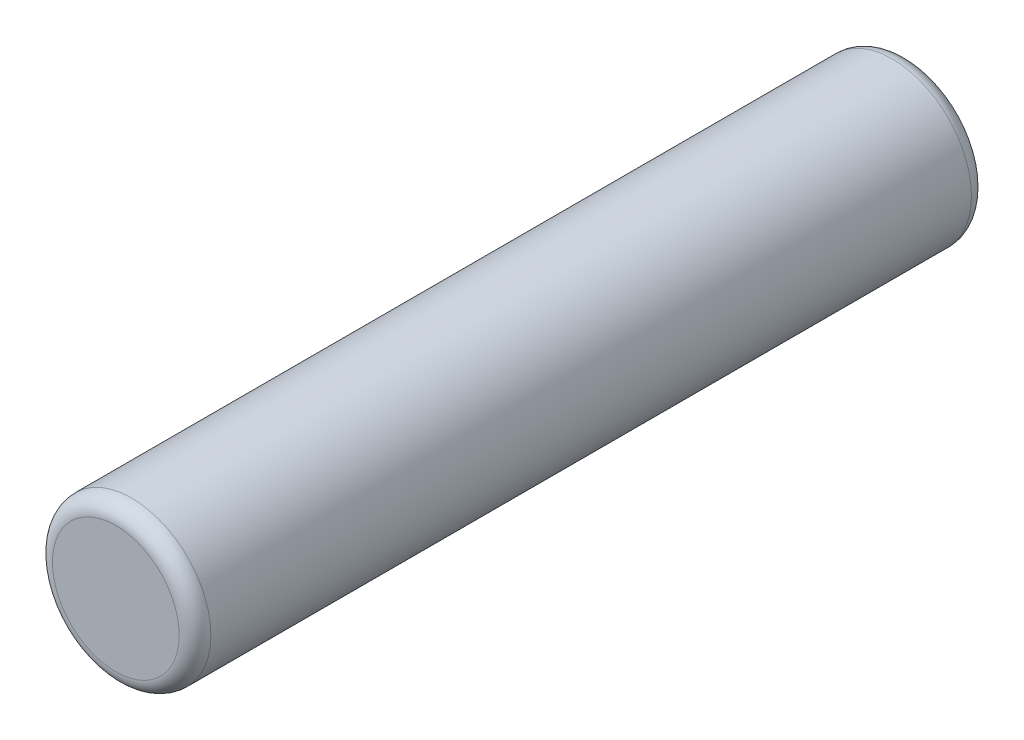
ISO-10303-21;
HEADER;
FILE_DESCRIPTION(('STEP AP214'),'2;1');
FILE_NAME('part.step','',(''),(''),'','','');
FILE_SCHEMA(('AUTOMOTIVE_DESIGN { 1 0 10303 214 1 1 1 1 }'));
ENDSEC;
DATA;
#1=APPLICATION_CONTEXT('core data for automotive mechanical design processes');
#2=APPLICATION_PROTOCOL_DEFINITION('international standard','automotive_design',2000,#1);
#3=PRODUCT_CONTEXT('',#1,'mechanical');
#4=PRODUCT('Part','Part','',(#3));
#5=PRODUCT_RELATED_PRODUCT_CATEGORY('part','',(#4));
#6=PRODUCT_DEFINITION_FORMATION('','',#4);
#7=PRODUCT_DEFINITION_CONTEXT('part definition',#1,'design');
#8=PRODUCT_DEFINITION('design','',#6,#7);
#9=PRODUCT_DEFINITION_SHAPE('','',#8);
#10=(LENGTH_UNIT() NAMED_UNIT(*) SI_UNIT(.MILLI.,.METRE.));
#11=(NAMED_UNIT(*) PLANE_ANGLE_UNIT() SI_UNIT($,.RADIAN.));
#12=(NAMED_UNIT(*) SI_UNIT($,.STERADIAN.) SOLID_ANGLE_UNIT());
#13=UNCERTAINTY_MEASURE_WITH_UNIT(LENGTH_MEASURE(1.E-05),#10,'distance_accuracy_value','');
#14=(GEOMETRIC_REPRESENTATION_CONTEXT(3) GLOBAL_UNCERTAINTY_ASSIGNED_CONTEXT((#13)) GLOBAL_UNIT_ASSIGNED_CONTEXT((#10,
#11,#12)) REPRESENTATION_CONTEXT('',''));
#15=CARTESIAN_POINT('',(0.,0.,0.));
#16=DIRECTION('',(0.,0.,1.));
#17=DIRECTION('',(1.,0.,0.));
#18=AXIS2_PLACEMENT_3D('',#15,#16,#17);
#19=CARTESIAN_POINT('',(0.,0.,100.));
#20=DIRECTION('',(0.,0.,-1.));
#21=DIRECTION('',(-1.,0.,0.));
#22=AXIS2_PLACEMENT_3D('',#19,#20,#21);
#23=CYLINDRICAL_SURFACE('',#22,10.);
#24=CARTESIAN_POINT('',(0.,0.,2.));
#25=DIRECTION('',(0.,0.,1.));
#26=DIRECTION('',(1.,0.,0.));
#27=AXIS2_PLACEMENT_3D('',#24,#25,#26);
#28=CIRCLE('',#27,10.);
#29=CARTESIAN_POINT('',(10.,0.,2.));
#30=VERTEX_POINT('',#29);
#31=EDGE_CURVE('E40',#30,#30,#28,.T.);
#32=ORIENTED_EDGE('',*,*,#31,.T.);
#33=EDGE_LOOP('',(#32));
#34=FACE_BOUND('',#33,.T.);
#35=CARTESIAN_POINT('',(0.,0.,98.));
#36=DIRECTION('',(0.,0.,1.));
#37=DIRECTION('',(1.,0.,0.));
#38=AXIS2_PLACEMENT_3D('',#35,#36,#37);
#39=CIRCLE('',#38,10.);
#40=CARTESIAN_POINT('',(10.,0.,98.));
#41=VERTEX_POINT('',#40);
#42=EDGE_CURVE('E44',#41,#41,#39,.F.);
#43=ORIENTED_EDGE('',*,*,#42,.T.);
#44=EDGE_LOOP('',(#43));
#45=FACE_BOUND('',#44,.T.);
#46=ADVANCED_FACE('F30',(#34,#45),#23,.T.);
#47=CARTESIAN_POINT('',(0.,0.,100.));
#48=DIRECTION('',(0.,0.,1.));
#49=DIRECTION('',(1.,0.,0.));
#50=AXIS2_PLACEMENT_3D('',#47,#48,#49);
#51=PLANE('',#50);
#52=CARTESIAN_POINT('',(0.,0.,100.));
#53=DIRECTION('',(0.,0.,1.));
#54=DIRECTION('',(1.,0.,0.));
#55=AXIS2_PLACEMENT_3D('',#52,#53,#54);
#56=CIRCLE('',#55,8.);
#57=CARTESIAN_POINT('',(8.,0.,100.));
#58=VERTEX_POINT('',#57);
#59=EDGE_CURVE('E10',#58,#58,#56,.T.);
#60=ORIENTED_EDGE('',*,*,#59,.T.);
#61=EDGE_LOOP('',(#60));
#62=FACE_BOUND('',#61,.T.);
#63=ADVANCED_FACE('F63',(#62),#51,.T.);
#64=CARTESIAN_POINT('',(0.,0.,0.));
#65=DIRECTION('',(0.,0.,1.));
#66=DIRECTION('',(1.,0.,0.));
#67=AXIS2_PLACEMENT_3D('',#64,#65,#66);
#68=PLANE('',#67);
#69=CARTESIAN_POINT('',(0.,0.,0.));
#70=DIRECTION('',(0.,0.,1.));
#71=DIRECTION('',(1.,0.,0.));
#72=AXIS2_PLACEMENT_3D('',#69,#70,#71);
#73=CIRCLE('',#72,8.);
#74=CARTESIAN_POINT('',(8.,0.,0.));
#75=VERTEX_POINT('',#74);
#76=EDGE_CURVE('E36',#75,#75,#73,.F.);
#77=ORIENTED_EDGE('',*,*,#76,.T.);
#78=EDGE_LOOP('',(#77));
#79=FACE_BOUND('',#78,.T.);
#80=ADVANCED_FACE('F59',(#79),#68,.F.);
#81=CARTESIAN_POINT('',(0.,0.,2.));
#82=DIRECTION('',(0.,0.,1.));
#83=DIRECTION('',(1.,0.,0.));
#84=AXIS2_PLACEMENT_3D('',#81,#82,#83);
#85=TOROIDAL_SURFACE('',#84,8.,2.);
#86=ORIENTED_EDGE('',*,*,#76,.F.);
#87=EDGE_LOOP('',(#86));
#88=FACE_BOUND('',#87,.T.);
#89=ORIENTED_EDGE('',*,*,#31,.F.);
#90=EDGE_LOOP('',(#89));
#91=FACE_BOUND('',#90,.T.);
#92=ADVANCED_FACE('F54',(#88,#91),#85,.T.);
#93=CARTESIAN_POINT('',(0.,0.,98.));
#94=DIRECTION('',(0.,0.,1.));
#95=DIRECTION('',(1.,0.,0.));
#96=AXIS2_PLACEMENT_3D('',#93,#94,#95);
#97=TOROIDAL_SURFACE('',#96,8.,2.);
#98=ORIENTED_EDGE('',*,*,#42,.F.);
#99=EDGE_LOOP('',(#98));
#100=FACE_BOUND('',#99,.T.);
#101=ORIENTED_EDGE('',*,*,#59,.F.);
#102=EDGE_LOOP('',(#101));
#103=FACE_BOUND('',#102,.T.);
#104=ADVANCED_FACE('F51',(#100,#103),#97,.T.);
#105=CLOSED_SHELL('',(#46,#63,#80,#92,#104));
#106=MANIFOLD_SOLID_BREP('B2',#105);
#107=ADVANCED_BREP_SHAPE_REPRESENTATION('',(#18,#106),#14);
#108=SHAPE_DEFINITION_REPRESENTATION(#9,#107);
ENDSEC;
END-ISO-10303-21;
